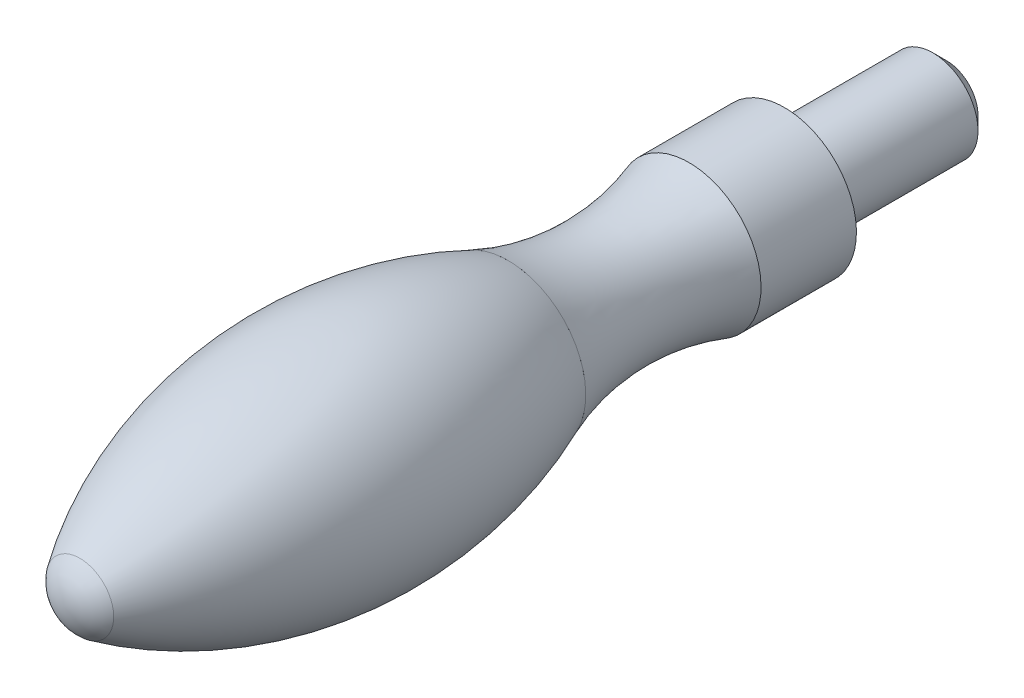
ISO-10303-21;
HEADER;
FILE_DESCRIPTION(('STEP AP214'),'2;1');
FILE_NAME('part.step','',(''),(''),'','','');
FILE_SCHEMA(('AUTOMOTIVE_DESIGN { 1 0 10303 214 1 1 1 1 }'));
ENDSEC;
DATA;
#1=APPLICATION_CONTEXT('core data for automotive mechanical design processes');
#2=APPLICATION_PROTOCOL_DEFINITION('international standard','automotive_design',2000,#1);
#3=PRODUCT_CONTEXT('',#1,'mechanical');
#4=PRODUCT('Part','Part','',(#3));
#5=PRODUCT_RELATED_PRODUCT_CATEGORY('part','',(#4));
#6=PRODUCT_DEFINITION_FORMATION('','',#4);
#7=PRODUCT_DEFINITION_CONTEXT('part definition',#1,'design');
#8=PRODUCT_DEFINITION('design','',#6,#7);
#9=PRODUCT_DEFINITION_SHAPE('','',#8);
#10=(LENGTH_UNIT() NAMED_UNIT(*) SI_UNIT(.MILLI.,.METRE.));
#11=(NAMED_UNIT(*) PLANE_ANGLE_UNIT() SI_UNIT($,.RADIAN.));
#12=(NAMED_UNIT(*) SI_UNIT($,.STERADIAN.) SOLID_ANGLE_UNIT());
#13=UNCERTAINTY_MEASURE_WITH_UNIT(LENGTH_MEASURE(1.E-05),#10,'distance_accuracy_value','');
#14=(GEOMETRIC_REPRESENTATION_CONTEXT(3) GLOBAL_UNCERTAINTY_ASSIGNED_CONTEXT((#13)) GLOBAL_UNIT_ASSIGNED_CONTEXT((#10,
#11,#12)) REPRESENTATION_CONTEXT('',''));
#15=CARTESIAN_POINT('',(0.,0.,0.));
#16=DIRECTION('',(0.,0.,1.));
#17=DIRECTION('',(1.,0.,0.));
#18=AXIS2_PLACEMENT_3D('',#15,#16,#17);
#19=CARTESIAN_POINT('',(0.,-1.38777878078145E-13,-23.));
#20=DIRECTION('',(0.,0.,-1.));
#21=DIRECTION('',(0.,-1.,0.));
#22=AXIS2_PLACEMENT_3D('',#19,#20,#21);
#23=CYLINDRICAL_SURFACE('',#22,8.00000000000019);
#24=CARTESIAN_POINT('',(0.,0.,0.));
#25=DIRECTION('',(0.,0.,-1.));
#26=DIRECTION('',(0.,-1.,0.));
#27=AXIS2_PLACEMENT_3D('',#24,#25,#26);
#28=CIRCLE('',#27,8.00000000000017);
#29=CARTESIAN_POINT('',(0.,-8.00000000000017,0.));
#30=VERTEX_POINT('',#29);
#31=EDGE_CURVE('E23',#30,#30,#28,.T.);
#32=ORIENTED_EDGE('',*,*,#31,.F.);
#33=EDGE_LOOP('',(#32));
#34=FACE_BOUND('',#33,.T.);
#35=CARTESIAN_POINT('',(0.,0.,10.594023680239));
#36=DIRECTION('',(0.,0.,-1.));
#37=DIRECTION('',(0.,-1.,0.));
#38=AXIS2_PLACEMENT_3D('',#35,#36,#37);
#39=CIRCLE('',#38,8.00000000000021);
#40=CARTESIAN_POINT('',(0.,-8.00000000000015,10.594023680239));
#41=VERTEX_POINT('',#40);
#42=EDGE_CURVE('E41',#41,#41,#39,.T.);
#43=ORIENTED_EDGE('',*,*,#42,.T.);
#44=EDGE_LOOP('',(#43));
#45=FACE_BOUND('',#44,.T.);
#46=ADVANCED_FACE('F12',(#34,#45),#23,.T.);
#47=CARTESIAN_POINT('',(0.,5.,0.));
#48=DIRECTION('',(0.,0.,-1.));
#49=DIRECTION('',(0.,-1.,0.));
#50=AXIS2_PLACEMENT_3D('',#47,#48,#49);
#51=PLANE('',#50);
#52=ORIENTED_EDGE('',*,*,#31,.T.);
#53=EDGE_LOOP('',(#52));
#54=FACE_BOUND('',#53,.T.);
#55=CARTESIAN_POINT('',(0.,0.,0.));
#56=DIRECTION('',(0.,0.,-1.));
#57=DIRECTION('',(0.,-1.,0.));
#58=AXIS2_PLACEMENT_3D('',#55,#56,#57);
#59=CIRCLE('',#58,5.00000000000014);
#60=CARTESIAN_POINT('',(0.,-5.00000000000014,0.));
#61=VERTEX_POINT('',#60);
#62=EDGE_CURVE('E27',#61,#61,#59,.T.);
#63=ORIENTED_EDGE('',*,*,#62,.F.);
#64=EDGE_LOOP('',(#63));
#65=FACE_BOUND('',#64,.T.);
#66=ADVANCED_FACE('F62',(#54,#65),#51,.T.);
#67=CARTESIAN_POINT('',(0.,-1.38777878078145E-13,-23.));
#68=DIRECTION('',(0.,0.,-1.));
#69=DIRECTION('',(0.,-1.,0.));
#70=AXIS2_PLACEMENT_3D('',#67,#68,#69);
#71=CYLINDRICAL_SURFACE('',#70,5.0000000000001);
#72=CARTESIAN_POINT('',(0.,-1.39113865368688E-13,-16.5));
#73=DIRECTION('',(0.,0.,-1.));
#74=DIRECTION('',(0.,1.,0.));
#75=AXIS2_PLACEMENT_3D('',#72,#73,#74);
#76=CIRCLE('',#75,5.0000000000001);
#77=CARTESIAN_POINT('',(0.,4.99999999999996,-16.5));
#78=VERTEX_POINT('',#77);
#79=EDGE_CURVE('E8',#78,#78,#76,.F.);
#80=ORIENTED_EDGE('',*,*,#79,.T.);
#81=EDGE_LOOP('',(#80));
#82=FACE_BOUND('',#81,.T.);
#83=ORIENTED_EDGE('',*,*,#62,.T.);
#84=EDGE_LOOP('',(#83));
#85=FACE_BOUND('',#84,.T.);
#86=ADVANCED_FACE('F68',(#82,#85),#71,.T.);
#87=CARTESIAN_POINT('',(0.,-1.11022302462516E-13,-18.));
#88=DIRECTION('',(0.,0.,-1.));
#89=DIRECTION('',(0.,-1.,0.));
#90=AXIS2_PLACEMENT_3D('',#87,#88,#89);
#91=PLANE('',#90);
#92=CARTESIAN_POINT('',(0.,-1.39036329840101E-13,-18.));
#93=DIRECTION('',(0.,0.,-1.));
#94=DIRECTION('',(0.,1.,0.));
#95=AXIS2_PLACEMENT_3D('',#92,#93,#94);
#96=CIRCLE('',#95,3.5);
#97=CARTESIAN_POINT('',(0.,3.49999999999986,-18.));
#98=VERTEX_POINT('',#97);
#99=EDGE_CURVE('E19',#98,#98,#96,.T.);
#100=ORIENTED_EDGE('',*,*,#99,.T.);
#101=EDGE_LOOP('',(#100));
#102=FACE_BOUND('',#101,.T.);
#103=ADVANCED_FACE('F75',(#102),#91,.T.);
#104=CARTESIAN_POINT('',(0.,4.44089209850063E-13,75.1));
#105=DIRECTION('',(-1.,0.,0.));
#106=DIRECTION('',(0.,0.,1.));
#107=AXIS2_PLACEMENT_3D('',#104,#105,#106);
#108=SPHERICAL_SURFACE('',#107,4.9);
#109=CARTESIAN_POINT('',(0.,4.44089209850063E-13,75.1));
#110=DIRECTION('',(0.,0.,-1.));
#111=DIRECTION('',(0.,-1.,0.));
#112=AXIS2_PLACEMENT_3D('',#109,#110,#111);
#113=SPHERICAL_SURFACE('',#112,4.9);
#114=CARTESIAN_POINT('',(0.,4.44089209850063E-13,78.2420604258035));
#115=DIRECTION('',(0.,0.,-1.));
#116=DIRECTION('',(0.,-1.,0.));
#117=AXIS2_PLACEMENT_3D('',#114,#115,#116);
#118=CIRCLE('',#117,3.75998088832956);
#119=CARTESIAN_POINT('',(0.,-3.75998088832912,78.2420604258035));
#120=VERTEX_POINT('',#119);
#121=EDGE_CURVE('E32',#120,#120,#118,.T.);
#122=ORIENTED_EDGE('',*,*,#121,.F.);
#123=EDGE_LOOP('',(#122));
#124=FACE_BOUND('',#123,.T.);
#125=ADVANCED_FACE('F78',(#124),#113,.T.);
#126=CARTESIAN_POINT('',(0.,2.77555756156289E-13,50.));
#127=DIRECTION('',(0.,0.,-1.));
#128=DIRECTION('',(0.,-1.,0.));
#129=AXIS2_PLACEMENT_3D('',#126,#127,#128);
#130=DEGENERATE_TOROIDAL_SURFACE('',#129,37.4999999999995,50.,.F.);
#131=CARTESIAN_POINT('',(0.,1.66533453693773E-13,30.6773156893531));
#132=DIRECTION('',(0.,0.,-1.));
#133=DIRECTION('',(0.,-1.,0.));
#134=AXIS2_PLACEMENT_3D('',#131,#132,#133);
#135=CIRCLE('',#134,8.61544070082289);
#136=CARTESIAN_POINT('',(0.,-8.61544070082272,30.6773156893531));
#137=VERTEX_POINT('',#136);
#138=EDGE_CURVE('E35',#137,#137,#135,.T.);
#139=ORIENTED_EDGE('',*,*,#138,.F.);
#140=EDGE_LOOP('',(#139));
#141=FACE_BOUND('',#140,.T.);
#142=ORIENTED_EDGE('',*,*,#121,.T.);
#143=EDGE_LOOP('',(#142));
#144=FACE_BOUND('',#143,.T.);
#145=ADVANCED_FACE('F58',(#141,#144),#130,.F.);
#146=CARTESIAN_POINT('',(0.,1.66533453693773E-13,30.6773156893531));
#147=DIRECTION('',(0.,0.,-1.));
#148=DIRECTION('',(0.,-1.,0.));
#149=AXIS2_PLACEMENT_3D('',#146,#147,#148);
#150=CONICAL_SURFACE('',#149,8.61544070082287,1.17401288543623);
#151=CARTESIAN_POINT('',(0.,1.66533453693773E-13,30.676679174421));
#152=DIRECTION('',(0.,0.,-1.));
#153=DIRECTION('',(0.,-1.,0.));
#154=AXIS2_PLACEMENT_3D('',#151,#152,#153);
#155=CIRCLE('',#154,8.61695980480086);
#156=CARTESIAN_POINT('',(0.,-8.61695980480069,30.676679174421));
#157=VERTEX_POINT('',#156);
#158=EDGE_CURVE('E38',#157,#157,#155,.T.);
#159=ORIENTED_EDGE('',*,*,#158,.F.);
#160=EDGE_LOOP('',(#159));
#161=FACE_BOUND('',#160,.T.);
#162=ORIENTED_EDGE('',*,*,#138,.T.);
#163=EDGE_LOOP('',(#162));
#164=FACE_BOUND('',#163,.T.);
#165=ADVANCED_FACE('F48',(#161,#164),#150,.T.);
#166=CARTESIAN_POINT('',(0.,1.11022302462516E-13,19.8));
#167=DIRECTION('',(0.,0.,-1.));
#168=DIRECTION('',(0.,-1.,0.));
#169=AXIS2_PLACEMENT_3D('',#166,#167,#168);
#170=TOROIDAL_SURFACE('',#169,35.5,29.);
#171=ORIENTED_EDGE('',*,*,#158,.T.);
#172=EDGE_LOOP('',(#171));
#173=FACE_BOUND('',#172,.T.);
#174=ORIENTED_EDGE('',*,*,#42,.F.);
#175=EDGE_LOOP('',(#174));
#176=FACE_BOUND('',#175,.T.);
#177=ADVANCED_FACE('F46',(#173,#176),#170,.F.);
#178=CARTESIAN_POINT('',(0.,-1.39036329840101E-13,-18.));
#179=DIRECTION('',(0.,0.,1.));
#180=DIRECTION('',(0.,-1.,0.));
#181=AXIS2_PLACEMENT_3D('',#178,#179,#180);
#182=CONICAL_SURFACE('',#181,3.5,0.785398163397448);
#183=ORIENTED_EDGE('',*,*,#79,.F.);
#184=EDGE_LOOP('',(#183));
#185=FACE_BOUND('',#184,.T.);
#186=ORIENTED_EDGE('',*,*,#99,.F.);
#187=EDGE_LOOP('',(#186));
#188=FACE_BOUND('',#187,.T.);
#189=ADVANCED_FACE('F14',(#185,#188),#182,.T.);
#190=CLOSED_SHELL('',(#46,#66,#86,#103,#125,#145,#165,#177,#189));
#191=MANIFOLD_SOLID_BREP('B1',#190);
#192=ADVANCED_BREP_SHAPE_REPRESENTATION('',(#18,#191),#14);
#193=SHAPE_DEFINITION_REPRESENTATION(#9,#192);
ENDSEC;
END-ISO-10303-21;
